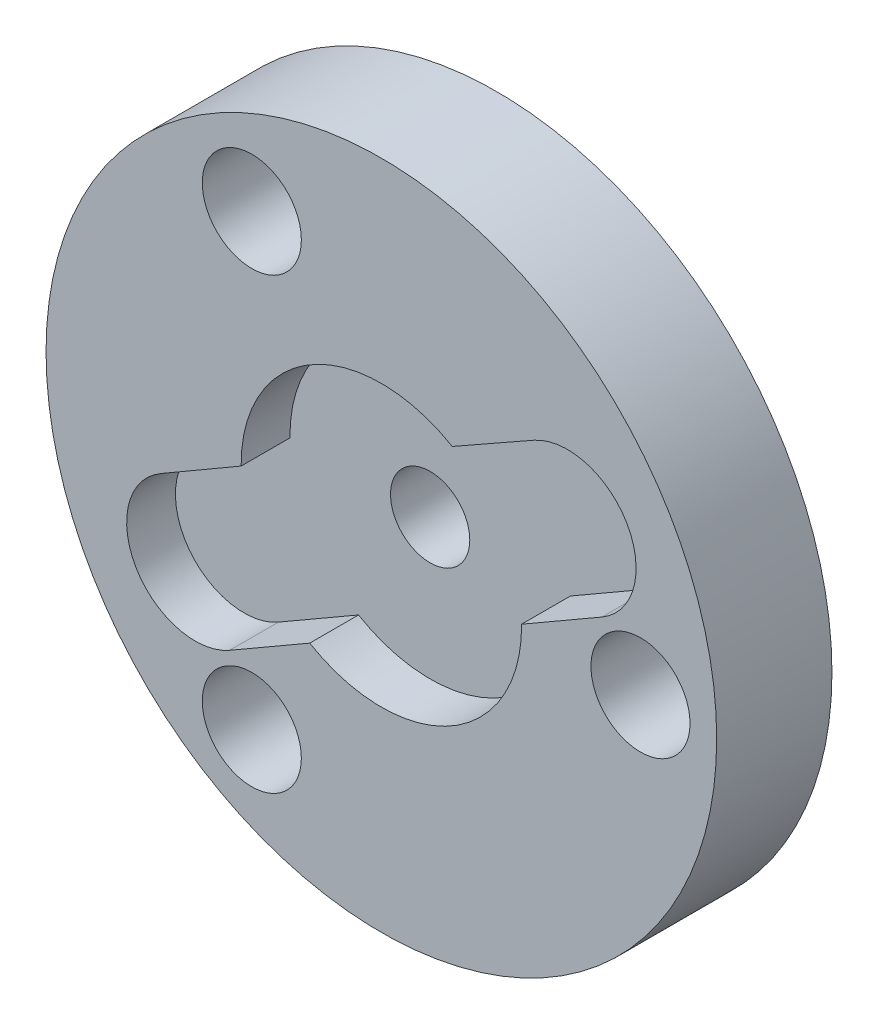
ISO-10303-21;
HEADER;
FILE_DESCRIPTION(('STEP AP214'),'2;1');
FILE_NAME('part.step','',(''),(''),'','','');
FILE_SCHEMA(('AUTOMOTIVE_DESIGN { 1 0 10303 214 1 1 1 1 }'));
ENDSEC;
DATA;
#1=APPLICATION_CONTEXT('core data for automotive mechanical design processes');
#2=APPLICATION_PROTOCOL_DEFINITION('international standard','automotive_design',2000,#1);
#3=PRODUCT_CONTEXT('',#1,'mechanical');
#4=PRODUCT('Part','Part','',(#3));
#5=PRODUCT_RELATED_PRODUCT_CATEGORY('part','',(#4));
#6=PRODUCT_DEFINITION_FORMATION('','',#4);
#7=PRODUCT_DEFINITION_CONTEXT('part definition',#1,'design');
#8=PRODUCT_DEFINITION('design','',#6,#7);
#9=PRODUCT_DEFINITION_SHAPE('','',#8);
#10=(LENGTH_UNIT() NAMED_UNIT(*) SI_UNIT(.MILLI.,.METRE.));
#11=(NAMED_UNIT(*) PLANE_ANGLE_UNIT() SI_UNIT($,.RADIAN.));
#12=(NAMED_UNIT(*) SI_UNIT($,.STERADIAN.) SOLID_ANGLE_UNIT());
#13=UNCERTAINTY_MEASURE_WITH_UNIT(LENGTH_MEASURE(1.E-05),#10,'distance_accuracy_value','');
#14=(GEOMETRIC_REPRESENTATION_CONTEXT(3) GLOBAL_UNCERTAINTY_ASSIGNED_CONTEXT((#13)) GLOBAL_UNIT_ASSIGNED_CONTEXT((#10,
#11,#12)) REPRESENTATION_CONTEXT('',''));
#15=CARTESIAN_POINT('',(0.,0.,0.));
#16=DIRECTION('',(0.,0.,1.));
#17=DIRECTION('',(1.,0.,0.));
#18=AXIS2_PLACEMENT_3D('',#15,#16,#17);
#19=CARTESIAN_POINT('',(0.,0.,0.));
#20=DIRECTION('',(0.,0.,1.));
#21=DIRECTION('',(1.,0.,0.));
#22=AXIS2_PLACEMENT_3D('',#19,#20,#21);
#23=CYLINDRICAL_SURFACE('',#22,1.3);
#24=CARTESIAN_POINT('',(0.,0.,0.));
#25=DIRECTION('',(0.,0.,1.));
#26=DIRECTION('',(1.,0.,0.));
#27=AXIS2_PLACEMENT_3D('',#24,#25,#26);
#28=CIRCLE('',#27,1.3);
#29=CARTESIAN_POINT('',(1.3,0.,0.));
#30=VERTEX_POINT('',#29);
#31=EDGE_CURVE('E192',#30,#30,#28,.T.);
#32=CARTESIAN_POINT('',(0.,0.,2.18109250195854));
#33=DIRECTION('',(0.,0.,1.));
#34=DIRECTION('',(1.,0.,0.));
#35=AXIS2_PLACEMENT_3D('',#32,#33,#34);
#36=CIRCLE('',#35,1.3);
#37=CARTESIAN_POINT('',(1.3,0.,2.18109250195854));
#38=VERTEX_POINT('',#37);
#39=EDGE_CURVE('E183',#38,#38,#36,.F.);
#40=CARTESIAN_POINT('',(1.3,0.,0.));
#41=CARTESIAN_POINT('',(1.3,0.,0.0227197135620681));
#42=CARTESIAN_POINT('',(1.3,0.,0.0454394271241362));
#43=CARTESIAN_POINT('',(1.3,0.,0.0908788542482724));
#44=CARTESIAN_POINT('',(1.3,0.,0.11359856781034));
#45=CARTESIAN_POINT('',(1.3,0.,0.159037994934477));
#46=CARTESIAN_POINT('',(1.3,0.,0.181757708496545));
#47=CARTESIAN_POINT('',(1.3,0.,0.227197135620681));
#48=CARTESIAN_POINT('',(1.3,0.,0.249916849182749));
#49=CARTESIAN_POINT('',(1.3,0.,0.295356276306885));
#50=CARTESIAN_POINT('',(1.3,0.,0.318075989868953));
#51=CARTESIAN_POINT('',(1.3,0.,0.363515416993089));
#52=CARTESIAN_POINT('',(1.3,0.,0.386235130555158));
#53=CARTESIAN_POINT('',(1.3,0.,0.431674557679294));
#54=CARTESIAN_POINT('',(1.3,0.,0.454394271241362));
#55=CARTESIAN_POINT('',(1.3,0.,0.499833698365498));
#56=CARTESIAN_POINT('',(1.3,0.,0.522553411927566));
#57=CARTESIAN_POINT('',(1.3,0.,0.567992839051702));
#58=CARTESIAN_POINT('',(1.3,0.,0.59071255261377));
#59=CARTESIAN_POINT('',(1.3,0.,0.636151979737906));
#60=CARTESIAN_POINT('',(1.3,0.,0.658871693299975));
#61=CARTESIAN_POINT('',(1.3,0.,0.704311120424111));
#62=CARTESIAN_POINT('',(1.3,0.,0.727030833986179));
#63=CARTESIAN_POINT('',(1.3,0.,0.772470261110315));
#64=CARTESIAN_POINT('',(1.3,0.,0.795189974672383));
#65=CARTESIAN_POINT('',(1.3,0.,0.840629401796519));
#66=CARTESIAN_POINT('',(1.3,0.,0.863349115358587));
#67=CARTESIAN_POINT('',(1.3,0.,0.908788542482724));
#68=CARTESIAN_POINT('',(1.3,0.,0.931508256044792));
#69=CARTESIAN_POINT('',(1.3,0.,0.976947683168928));
#70=CARTESIAN_POINT('',(1.3,0.,0.999667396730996));
#71=CARTESIAN_POINT('',(1.3,0.,1.04510682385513));
#72=CARTESIAN_POINT('',(1.3,0.,1.0678265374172));
#73=CARTESIAN_POINT('',(1.3,0.,1.11326596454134));
#74=CARTESIAN_POINT('',(1.3,0.,1.1359856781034));
#75=CARTESIAN_POINT('',(1.3,0.,1.18142510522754));
#76=CARTESIAN_POINT('',(1.3,0.,1.20414481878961));
#77=CARTESIAN_POINT('',(1.3,0.,1.24958424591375));
#78=CARTESIAN_POINT('',(1.3,0.,1.27230395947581));
#79=CARTESIAN_POINT('',(1.3,0.,1.31774338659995));
#80=CARTESIAN_POINT('',(1.3,0.,1.34046310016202));
#81=CARTESIAN_POINT('',(1.3,0.,1.38590252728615));
#82=CARTESIAN_POINT('',(1.3,0.,1.40862224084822));
#83=CARTESIAN_POINT('',(1.3,0.,1.45406166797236));
#84=CARTESIAN_POINT('',(1.3,0.,1.47678138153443));
#85=CARTESIAN_POINT('',(1.3,0.,1.52222080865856));
#86=CARTESIAN_POINT('',(1.3,0.,1.54494052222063));
#87=CARTESIAN_POINT('',(1.3,0.,1.59037994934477));
#88=CARTESIAN_POINT('',(1.3,0.,1.61309966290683));
#89=CARTESIAN_POINT('',(1.3,0.,1.65853909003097));
#90=CARTESIAN_POINT('',(1.3,0.,1.68125880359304));
#91=CARTESIAN_POINT('',(1.3,0.,1.72669823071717));
#92=CARTESIAN_POINT('',(1.3,0.,1.74941794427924));
#93=CARTESIAN_POINT('',(1.3,0.,1.79485737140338));
#94=CARTESIAN_POINT('',(1.3,0.,1.81757708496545));
#95=CARTESIAN_POINT('',(1.3,0.,1.86301651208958));
#96=CARTESIAN_POINT('',(1.3,0.,1.88573622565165));
#97=CARTESIAN_POINT('',(1.3,0.,1.93117565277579));
#98=CARTESIAN_POINT('',(1.3,0.,1.95389536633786));
#99=CARTESIAN_POINT('',(1.3,0.,1.99933479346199));
#100=CARTESIAN_POINT('',(1.3,0.,2.02205450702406));
#101=CARTESIAN_POINT('',(1.3,0.,2.0674939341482));
#102=CARTESIAN_POINT('',(1.3,0.,2.09021364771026));
#103=CARTESIAN_POINT('',(1.3,0.,2.1356530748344));
#104=CARTESIAN_POINT('',(1.3,0.,2.15837278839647));
#105=CARTESIAN_POINT('',(1.3,0.,2.18109250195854));
#106=B_SPLINE_CURVE_WITH_KNOTS('',3,(#40,#41,#42,#43,#44,#45,#46,#47,#48,#49,#50,#51,#52,#53,
#54,#55,#56,#57,#58,#59,#60,#61,#62,#63,#64,#65,#66,#67,#68,#69,#70,#71,#72,#73,#74,#75,#76,#77,
#78,#79,#80,#81,#82,#83,#84,#85,#86,#87,#88,#89,#90,#91,#92,#93,#94,#95,#96,#97,#98,#99,#100,
#101,#102,#103,#104,#105),.UNSPECIFIED.,.F.,.F.,(4,2,2,2,2,2,2,2,2,2,2,2,2,2,2,2,2,2,2,2,2,2,2,
2,2,2,2,2,2,2,2,2,4),(0.,0.0681591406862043,0.136318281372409,0.204477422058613,
0.272636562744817,0.340795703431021,0.408954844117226,0.47711398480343,0.545273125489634,
0.613432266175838,0.681591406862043,0.749750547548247,0.817909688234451,0.886068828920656,
0.95422796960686,1.02238711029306,1.09054625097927,1.15870539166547,1.22686453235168,
1.29502367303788,1.36318281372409,1.43134195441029,1.49950109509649,1.5676602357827,
1.6358193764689,1.70397851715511,1.77213765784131,1.84029679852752,1.90845593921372,
1.97661507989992,2.04477422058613,2.11293336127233,2.18109250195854),.UNSPECIFIED.);
#107=EDGE_CURVE('BSEAM39',#30,#38,#106,.T.);
#108=ORIENTED_EDGE('',*,*,#31,.F.);
#109=ORIENTED_EDGE('',*,*,#39,.F.);
#110=ORIENTED_EDGE('',*,*,#107,.T.);
#111=ORIENTED_EDGE('',*,*,#107,.F.);
#112=EDGE_LOOP('',(#108,#110,#109,#111));
#113=FACE_BOUND('',#112,.T.);
#114=ADVANCED_FACE('F39',(#113),#23,.F.);
#115=CARTESIAN_POINT('',(0.,0.,3.78109250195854));
#116=DIRECTION('',(0.,0.,-1.));
#117=DIRECTION('',(-1.,0.,0.));
#118=AXIS2_PLACEMENT_3D('',#115,#116,#117);
#119=CYLINDRICAL_SURFACE('',#118,11.);
#120=CARTESIAN_POINT('',(0.,0.,3.78109250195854));
#121=DIRECTION('',(0.,0.,1.));
#122=DIRECTION('',(1.,0.,0.));
#123=AXIS2_PLACEMENT_3D('',#120,#121,#122);
#124=CIRCLE('',#123,11.);
#125=CARTESIAN_POINT('',(-11.,0.,3.78109250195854));
#126=VERTEX_POINT('',#125);
#127=EDGE_CURVE('E11',#126,#126,#124,.T.);
#128=CARTESIAN_POINT('',(0.,0.,0.));
#129=DIRECTION('',(0.,0.,1.));
#130=DIRECTION('',(1.,0.,0.));
#131=AXIS2_PLACEMENT_3D('',#128,#129,#130);
#132=CIRCLE('',#131,11.);
#133=CARTESIAN_POINT('',(-11.,0.,0.));
#134=VERTEX_POINT('',#133);
#135=EDGE_CURVE('E43',#134,#134,#132,.T.);
#136=CARTESIAN_POINT('',(-11.,0.,3.78109250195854));
#137=CARTESIAN_POINT('',(-11.,0.,3.7417061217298));
#138=CARTESIAN_POINT('',(-11.,0.,3.70231974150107));
#139=CARTESIAN_POINT('',(-11.,0.,3.6235469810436));
#140=CARTESIAN_POINT('',(-11.,0.,3.58416060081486));
#141=CARTESIAN_POINT('',(-11.,0.,3.50538784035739));
#142=CARTESIAN_POINT('',(-11.,0.,3.46600146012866));
#143=CARTESIAN_POINT('',(-11.,0.,3.38722869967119));
#144=CARTESIAN_POINT('',(-11.,0.,3.34784231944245));
#145=CARTESIAN_POINT('',(-11.,0.,3.26906955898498));
#146=CARTESIAN_POINT('',(-11.,0.,3.22968317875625));
#147=CARTESIAN_POINT('',(-11.,0.,3.15091041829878));
#148=CARTESIAN_POINT('',(-11.,0.,3.11152403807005));
#149=CARTESIAN_POINT('',(-11.,0.,3.03275127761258));
#150=CARTESIAN_POINT('',(-11.,0.,2.99336489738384));
#151=CARTESIAN_POINT('',(-11.,0.,2.91459213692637));
#152=CARTESIAN_POINT('',(-11.,0.,2.87520575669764));
#153=CARTESIAN_POINT('',(-11.,0.,2.79643299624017));
#154=CARTESIAN_POINT('',(-11.,0.,2.75704661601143));
#155=CARTESIAN_POINT('',(-11.,0.,2.67827385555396));
#156=CARTESIAN_POINT('',(-11.,0.,2.63888747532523));
#157=CARTESIAN_POINT('',(-11.,0.,2.56011471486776));
#158=CARTESIAN_POINT('',(-11.,0.,2.52072833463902));
#159=CARTESIAN_POINT('',(-11.,0.,2.44195557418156));
#160=CARTESIAN_POINT('',(-11.,0.,2.40256919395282));
#161=CARTESIAN_POINT('',(-11.,0.,2.32379643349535));
#162=CARTESIAN_POINT('',(-11.,0.,2.28441005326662));
#163=CARTESIAN_POINT('',(-11.,0.,2.20563729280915));
#164=CARTESIAN_POINT('',(-11.,0.,2.16625091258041));
#165=CARTESIAN_POINT('',(-11.,0.,2.08747815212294));
#166=CARTESIAN_POINT('',(-11.,0.,2.04809177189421));
#167=CARTESIAN_POINT('',(-11.,0.,1.96931901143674));
#168=CARTESIAN_POINT('',(-11.,0.,1.929932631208));
#169=CARTESIAN_POINT('',(-11.,0.,1.85115987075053));
#170=CARTESIAN_POINT('',(-11.,0.,1.8117734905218));
#171=CARTESIAN_POINT('',(-11.,0.,1.73300073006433));
#172=CARTESIAN_POINT('',(-11.,0.,1.69361434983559));
#173=CARTESIAN_POINT('',(-11.,0.,1.61484158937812));
#174=CARTESIAN_POINT('',(-11.,0.,1.57545520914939));
#175=CARTESIAN_POINT('',(-11.,0.,1.49668244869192));
#176=CARTESIAN_POINT('',(-11.,0.,1.45729606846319));
#177=CARTESIAN_POINT('',(-11.,0.,1.37852330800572));
#178=CARTESIAN_POINT('',(-11.,0.,1.33913692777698));
#179=CARTESIAN_POINT('',(-11.,0.,1.26036416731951));
#180=CARTESIAN_POINT('',(-11.,0.,1.22097778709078));
#181=CARTESIAN_POINT('',(-11.,0.,1.14220502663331));
#182=CARTESIAN_POINT('',(-11.,0.,1.10281864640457));
#183=CARTESIAN_POINT('',(-11.,0.,1.0240458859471));
#184=CARTESIAN_POINT('',(-11.,0.,0.984659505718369));
#185=CARTESIAN_POINT('',(-11.,0.,0.905886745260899));
#186=CARTESIAN_POINT('',(-11.,0.,0.866500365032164));
#187=CARTESIAN_POINT('',(-11.,0.,0.787727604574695));
#188=CARTESIAN_POINT('',(-11.,0.,0.74834122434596));
#189=CARTESIAN_POINT('',(-11.,0.,0.669568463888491));
#190=CARTESIAN_POINT('',(-11.,0.,0.630182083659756));
#191=CARTESIAN_POINT('',(-11.,0.,0.551409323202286));
#192=CARTESIAN_POINT('',(-11.,0.,0.512022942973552));
#193=CARTESIAN_POINT('',(-11.,0.,0.433250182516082));
#194=CARTESIAN_POINT('',(-11.,0.,0.393863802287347));
#195=CARTESIAN_POINT('',(-11.,0.,0.315091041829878));
#196=CARTESIAN_POINT('',(-11.,0.,0.275704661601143));
#197=CARTESIAN_POINT('',(-11.,0.,0.196931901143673));
#198=CARTESIAN_POINT('',(-11.,0.,0.157545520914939));
#199=CARTESIAN_POINT('',(-11.,0.,0.0787727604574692));
#200=CARTESIAN_POINT('',(-11.,0.,0.0393863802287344));
#201=CARTESIAN_POINT('',(-11.,0.,0.));
#202=B_SPLINE_CURVE_WITH_KNOTS('',3,(#136,#137,#138,#139,#140,#141,#142,#143,#144,#145,#146,
#147,#148,#149,#150,#151,#152,#153,#154,#155,#156,#157,#158,#159,#160,#161,#162,#163,#164,#165,
#166,#167,#168,#169,#170,#171,#172,#173,#174,#175,#176,#177,#178,#179,#180,#181,#182,#183,#184,
#185,#186,#187,#188,#189,#190,#191,#192,#193,#194,#195,#196,#197,#198,#199,#200,#201),
.UNSPECIFIED.,.F.,.F.,(4,2,2,2,2,2,2,2,2,2,2,2,2,2,2,2,2,2,2,2,2,2,2,2,2,2,2,2,2,2,2,2,4),(0.,
0.118159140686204,0.236318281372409,0.354477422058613,0.472636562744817,0.590795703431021,
0.708954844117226,0.82711398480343,0.945273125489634,1.06343226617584,1.18159140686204,
1.29975054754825,1.41790968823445,1.53606882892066,1.65422796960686,1.77238711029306,
1.89054625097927,2.00870539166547,2.12686453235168,2.24502367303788,2.36318281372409,
2.48134195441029,2.59950109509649,2.7176602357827,2.8358193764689,2.95397851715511,
3.07213765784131,3.19029679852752,3.30845593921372,3.42661507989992,3.54477422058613,
3.66293336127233,3.78109250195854),.UNSPECIFIED.);
#203=EDGE_CURVE('BSEAM41',#126,#134,#202,.T.);
#204=ORIENTED_EDGE('',*,*,#127,.F.);
#205=ORIENTED_EDGE('',*,*,#135,.T.);
#206=ORIENTED_EDGE('',*,*,#203,.T.);
#207=ORIENTED_EDGE('',*,*,#203,.F.);
#208=EDGE_LOOP('',(#204,#206,#205,#207));
#209=FACE_BOUND('',#208,.T.);
#210=ADVANCED_FACE('F41',(#209),#119,.T.);
#211=CARTESIAN_POINT('',(0.,0.,3.78109250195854));
#212=DIRECTION('',(0.,0.,1.));
#213=DIRECTION('',(1.,0.,0.));
#214=AXIS2_PLACEMENT_3D('',#211,#212,#213);
#215=PLANE('',#214);
#216=CARTESIAN_POINT('',(0.,0.,3.78109250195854));
#217=DIRECTION('',(0.,0.,1.));
#218=DIRECTION('',(1.,0.,0.));
#219=AXIS2_PLACEMENT_3D('',#216,#217,#218);
#220=CIRCLE('',#219,4.6);
#221=CARTESIAN_POINT('',(2.32469305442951,3.96935790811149,3.78109250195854));
#222=VERTEX_POINT('',#221);
#223=CARTESIAN_POINT('',(-4.59973302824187,-0.0495587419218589,3.78109250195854));
#224=VERTEX_POINT('',#223);
#225=EDGE_CURVE('E55',#222,#224,#220,.T.);
#226=ORIENTED_EDGE('',*,*,#225,.F.);
#227=DIRECTION('',(-0.870114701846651,-0.492849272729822,0.));
#228=VECTOR('',#227,1.);
#229=CARTESIAN_POINT('',(-1.13753229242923,2.00828859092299,3.78109250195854));
#230=LINE('',#229,#228);
#231=CARTESIAN_POINT('',(4.9965682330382,5.48275807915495,3.78109250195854));
#232=VERTEX_POINT('',#231);
#233=EDGE_CURVE('E156',#232,#222,#230,.T.);
#234=ORIENTED_EDGE('',*,*,#233,.F.);
#235=CARTESIAN_POINT('',(6.1054790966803,3.52499999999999,3.78109250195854));
#236=DIRECTION('',(0.,0.,1.));
#237=DIRECTION('',(1.,0.,0.));
#238=AXIS2_PLACEMENT_3D('',#235,#236,#237);
#239=CIRCLE('',#238,2.25);
#240=CARTESIAN_POINT('',(7.23047828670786,1.57644237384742,3.78109250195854));
#241=VERTEX_POINT('',#240);
#242=EDGE_CURVE('E158',#241,#232,#239,.T.);
#243=ORIENTED_EDGE('',*,*,#242,.F.);
#244=DIRECTION('',(0.866025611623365,0.499999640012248,0.));
#245=VECTOR('',#244,1.);
#246=CARTESIAN_POINT('',(1.12499772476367,-1.94855508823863,3.78109250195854));
#247=LINE('',#246,#245);
#248=CARTESIAN_POINT('',(4.59964025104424,0.0575287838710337,3.78109250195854));
#249=VERTEX_POINT('',#248);
#250=EDGE_CURVE('E115',#249,#241,#247,.T.);
#251=ORIENTED_EDGE('',*,*,#250,.F.);
#252=CARTESIAN_POINT('',(0.,0.,3.78109250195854));
#253=DIRECTION('',(0.,0.,1.));
#254=DIRECTION('',(1.,0.,0.));
#255=AXIS2_PLACEMENT_3D('',#252,#253,#254);
#256=CIRCLE('',#255,4.6);
#257=CARTESIAN_POINT('',(-2.34964480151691,-3.95463896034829,3.78109250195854));
#258=VERTEX_POINT('',#257);
#259=EDGE_CURVE('E397',#258,#249,#256,.T.);
#260=ORIENTED_EDGE('',*,*,#259,.F.);
#261=CARTESIAN_POINT('',(-4.97603524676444,-5.47098473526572,3.78109250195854));
#262=VERTEX_POINT('',#261);
#263=EDGE_CURVE('E392',#262,#258,#247,.T.);
#264=ORIENTED_EDGE('',*,*,#263,.F.);
#265=CARTESIAN_POINT('',(-6.1054790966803,-3.52499999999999,3.78109250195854));
#266=DIRECTION('',(0.,0.,1.));
#267=DIRECTION('',(1.,0.,0.));
#268=AXIS2_PLACEMENT_3D('',#265,#266,#267);
#269=CIRCLE('',#268,2.25);
#270=CARTESIAN_POINT('',(-7.23492294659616,-1.57901526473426,3.78109250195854));
#271=VERTEX_POINT('',#270);
#272=EDGE_CURVE('E398',#271,#262,#269,.T.);
#273=ORIENTED_EDGE('',*,*,#272,.F.);
#274=DIRECTION('',(-0.864882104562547,-0.50197504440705,0.));
#275=VECTOR('',#274,1.);
#276=CARTESIAN_POINT('',(-1.13751998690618,1.95989958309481,3.78109250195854));
#277=LINE('',#276,#275);
#278=EDGE_CURVE('E406',#224,#271,#277,.T.);
#279=ORIENTED_EDGE('',*,*,#278,.F.);
#280=EDGE_LOOP('',(#226,#234,#243,#251,#260,#264,#273,#279));
#281=FACE_BOUND('',#280,.T.);
#282=CARTESIAN_POINT('',(-4.24999999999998,7.36121593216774,3.78109250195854));
#283=DIRECTION('',(0.,0.,1.));
#284=DIRECTION('',(1.,0.,0.));
#285=AXIS2_PLACEMENT_3D('',#282,#283,#284);
#286=CIRCLE('',#285,1.625);
#287=CARTESIAN_POINT('',(-2.62499999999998,7.36121593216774,3.78109250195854));
#288=VERTEX_POINT('',#287);
#289=EDGE_CURVE('E188',#288,#288,#286,.T.);
#290=ORIENTED_EDGE('',*,*,#289,.F.);
#291=EDGE_LOOP('',(#290));
#292=FACE_BOUND('',#291,.T.);
#293=CARTESIAN_POINT('',(-4.24999999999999,-7.36121593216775,3.78109250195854));
#294=DIRECTION('',(0.,0.,1.));
#295=DIRECTION('',(1.,0.,0.));
#296=AXIS2_PLACEMENT_3D('',#293,#294,#295);
#297=CIRCLE('',#296,1.625);
#298=CARTESIAN_POINT('',(-2.62499999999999,-7.36121593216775,3.78109250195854));
#299=VERTEX_POINT('',#298);
#300=EDGE_CURVE('E200',#299,#299,#297,.T.);
#301=ORIENTED_EDGE('',*,*,#300,.F.);
#302=EDGE_LOOP('',(#301));
#303=FACE_BOUND('',#302,.T.);
#304=CARTESIAN_POINT('',(8.5,0.,3.78109250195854));
#305=DIRECTION('',(0.,0.,1.));
#306=DIRECTION('',(1.,0.,0.));
#307=AXIS2_PLACEMENT_3D('',#304,#305,#306);
#308=CIRCLE('',#307,1.625);
#309=CARTESIAN_POINT('',(10.125,0.,3.78109250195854));
#310=VERTEX_POINT('',#309);
#311=EDGE_CURVE('E167',#310,#310,#308,.T.);
#312=ORIENTED_EDGE('',*,*,#311,.F.);
#313=EDGE_LOOP('',(#312));
#314=FACE_BOUND('',#313,.T.);
#315=ORIENTED_EDGE('',*,*,#127,.T.);
#316=EDGE_LOOP('',(#315));
#317=FACE_BOUND('',#316,.T.);
#318=ADVANCED_FACE('F214',(#281,#292,#303,#314,#317),#215,.T.);
#319=CARTESIAN_POINT('',(0.,0.,0.));
#320=DIRECTION('',(0.,0.,1.));
#321=DIRECTION('',(1.,0.,0.));
#322=AXIS2_PLACEMENT_3D('',#319,#320,#321);
#323=PLANE('',#322);
#324=CARTESIAN_POINT('',(-4.24999999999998,7.36121593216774,0.));
#325=DIRECTION('',(0.,0.,1.));
#326=DIRECTION('',(1.,0.,0.));
#327=AXIS2_PLACEMENT_3D('',#324,#325,#326);
#328=CIRCLE('',#327,1.625);
#329=CARTESIAN_POINT('',(-2.62499999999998,7.36121593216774,0.));
#330=VERTEX_POINT('',#329);
#331=EDGE_CURVE('E184',#330,#330,#328,.T.);
#332=ORIENTED_EDGE('',*,*,#331,.T.);
#333=EDGE_LOOP('',(#332));
#334=FACE_BOUND('',#333,.T.);
#335=ORIENTED_EDGE('',*,*,#31,.T.);
#336=EDGE_LOOP('',(#335));
#337=FACE_BOUND('',#336,.T.);
#338=CARTESIAN_POINT('',(-4.24999999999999,-7.36121593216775,0.));
#339=DIRECTION('',(0.,0.,1.));
#340=DIRECTION('',(1.,0.,0.));
#341=AXIS2_PLACEMENT_3D('',#338,#339,#340);
#342=CIRCLE('',#341,1.625);
#343=CARTESIAN_POINT('',(-2.62499999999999,-7.36121593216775,0.));
#344=VERTEX_POINT('',#343);
#345=EDGE_CURVE('E196',#344,#344,#342,.T.);
#346=ORIENTED_EDGE('',*,*,#345,.T.);
#347=EDGE_LOOP('',(#346));
#348=FACE_BOUND('',#347,.T.);
#349=CARTESIAN_POINT('',(8.5,0.,0.));
#350=DIRECTION('',(0.,0.,1.));
#351=DIRECTION('',(1.,0.,0.));
#352=AXIS2_PLACEMENT_3D('',#349,#350,#351);
#353=CIRCLE('',#352,1.625);
#354=CARTESIAN_POINT('',(10.125,0.,0.));
#355=VERTEX_POINT('',#354);
#356=EDGE_CURVE('E204',#355,#355,#353,.T.);
#357=ORIENTED_EDGE('',*,*,#356,.T.);
#358=EDGE_LOOP('',(#357));
#359=FACE_BOUND('',#358,.T.);
#360=ORIENTED_EDGE('',*,*,#135,.F.);
#361=EDGE_LOOP('',(#360));
#362=FACE_BOUND('',#361,.T.);
#363=ADVANCED_FACE('F217',(#334,#337,#348,#359,#362),#323,.F.);
#364=CARTESIAN_POINT('',(8.5,0.,0.));
#365=DIRECTION('',(0.,0.,1.));
#366=DIRECTION('',(1.,0.,0.));
#367=AXIS2_PLACEMENT_3D('',#364,#365,#366);
#368=CYLINDRICAL_SURFACE('',#367,1.625);
#369=CARTESIAN_POINT('',(10.125,0.,0.));
#370=CARTESIAN_POINT('',(10.125,0.,0.0393863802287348));
#371=CARTESIAN_POINT('',(10.125,0.,0.0787727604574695));
#372=CARTESIAN_POINT('',(10.125,0.,0.157545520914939));
#373=CARTESIAN_POINT('',(10.125,0.,0.196931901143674));
#374=CARTESIAN_POINT('',(10.125,0.,0.275704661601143));
#375=CARTESIAN_POINT('',(10.125,0.,0.315091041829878));
#376=CARTESIAN_POINT('',(10.125,0.,0.393863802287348));
#377=CARTESIAN_POINT('',(10.125,0.,0.433250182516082));
#378=CARTESIAN_POINT('',(10.125,0.,0.512022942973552));
#379=CARTESIAN_POINT('',(10.125,0.,0.551409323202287));
#380=CARTESIAN_POINT('',(10.125,0.,0.630182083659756));
#381=CARTESIAN_POINT('',(10.125,0.,0.669568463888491));
#382=CARTESIAN_POINT('',(10.125,0.,0.74834122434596));
#383=CARTESIAN_POINT('',(10.125,0.,0.787727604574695));
#384=CARTESIAN_POINT('',(10.125,0.,0.866500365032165));
#385=CARTESIAN_POINT('',(10.125,0.,0.905886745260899));
#386=CARTESIAN_POINT('',(10.125,0.,0.984659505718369));
#387=CARTESIAN_POINT('',(10.125,0.,1.0240458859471));
#388=CARTESIAN_POINT('',(10.125,0.,1.10281864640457));
#389=CARTESIAN_POINT('',(10.125,0.,1.14220502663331));
#390=CARTESIAN_POINT('',(10.125,0.,1.22097778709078));
#391=CARTESIAN_POINT('',(10.125,0.,1.26036416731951));
#392=CARTESIAN_POINT('',(10.125,0.,1.33913692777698));
#393=CARTESIAN_POINT('',(10.125,0.,1.37852330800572));
#394=CARTESIAN_POINT('',(10.125,0.,1.45729606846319));
#395=CARTESIAN_POINT('',(10.125,0.,1.49668244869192));
#396=CARTESIAN_POINT('',(10.125,0.,1.57545520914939));
#397=CARTESIAN_POINT('',(10.125,0.,1.61484158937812));
#398=CARTESIAN_POINT('',(10.125,0.,1.69361434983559));
#399=CARTESIAN_POINT('',(10.125,0.,1.73300073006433));
#400=CARTESIAN_POINT('',(10.125,0.,1.8117734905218));
#401=CARTESIAN_POINT('',(10.125,0.,1.85115987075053));
#402=CARTESIAN_POINT('',(10.125,0.,1.929932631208));
#403=CARTESIAN_POINT('',(10.125,0.,1.96931901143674));
#404=CARTESIAN_POINT('',(10.125,0.,2.04809177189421));
#405=CARTESIAN_POINT('',(10.125,0.,2.08747815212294));
#406=CARTESIAN_POINT('',(10.125,0.,2.16625091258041));
#407=CARTESIAN_POINT('',(10.125,0.,2.20563729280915));
#408=CARTESIAN_POINT('',(10.125,0.,2.28441005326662));
#409=CARTESIAN_POINT('',(10.125,0.,2.32379643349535));
#410=CARTESIAN_POINT('',(10.125,0.,2.40256919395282));
#411=CARTESIAN_POINT('',(10.125,0.,2.44195557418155));
#412=CARTESIAN_POINT('',(10.125,0.,2.52072833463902));
#413=CARTESIAN_POINT('',(10.125,0.,2.56011471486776));
#414=CARTESIAN_POINT('',(10.125,0.,2.63888747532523));
#415=CARTESIAN_POINT('',(10.125,0.,2.67827385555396));
#416=CARTESIAN_POINT('',(10.125,0.,2.75704661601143));
#417=CARTESIAN_POINT('',(10.125,0.,2.79643299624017));
#418=CARTESIAN_POINT('',(10.125,0.,2.87520575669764));
#419=CARTESIAN_POINT('',(10.125,0.,2.91459213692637));
#420=CARTESIAN_POINT('',(10.125,0.,2.99336489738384));
#421=CARTESIAN_POINT('',(10.125,0.,3.03275127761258));
#422=CARTESIAN_POINT('',(10.125,0.,3.11152403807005));
#423=CARTESIAN_POINT('',(10.125,0.,3.15091041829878));
#424=CARTESIAN_POINT('',(10.125,0.,3.22968317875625));
#425=CARTESIAN_POINT('',(10.125,0.,3.26906955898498));
#426=CARTESIAN_POINT('',(10.125,0.,3.34784231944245));
#427=CARTESIAN_POINT('',(10.125,0.,3.38722869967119));
#428=CARTESIAN_POINT('',(10.125,0.,3.46600146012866));
#429=CARTESIAN_POINT('',(10.125,0.,3.50538784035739));
#430=CARTESIAN_POINT('',(10.125,0.,3.58416060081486));
#431=CARTESIAN_POINT('',(10.125,0.,3.6235469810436));
#432=CARTESIAN_POINT('',(10.125,0.,3.70231974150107));
#433=CARTESIAN_POINT('',(10.125,0.,3.7417061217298));
#434=CARTESIAN_POINT('',(10.125,0.,3.78109250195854));
#435=B_SPLINE_CURVE_WITH_KNOTS('',3,(#369,#370,#371,#372,#373,#374,#375,#376,#377,#378,#379,
#380,#381,#382,#383,#384,#385,#386,#387,#388,#389,#390,#391,#392,#393,#394,#395,#396,#397,#398,
#399,#400,#401,#402,#403,#404,#405,#406,#407,#408,#409,#410,#411,#412,#413,#414,#415,#416,#417,
#418,#419,#420,#421,#422,#423,#424,#425,#426,#427,#428,#429,#430,#431,#432,#433,#434),
.UNSPECIFIED.,.F.,.F.,(4,2,2,2,2,2,2,2,2,2,2,2,2,2,2,2,2,2,2,2,2,2,2,2,2,2,2,2,2,2,2,2,4),(0.,
0.118159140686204,0.236318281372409,0.354477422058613,0.472636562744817,0.590795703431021,
0.708954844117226,0.82711398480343,0.945273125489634,1.06343226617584,1.18159140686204,
1.29975054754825,1.41790968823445,1.53606882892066,1.65422796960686,1.77238711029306,
1.89054625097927,2.00870539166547,2.12686453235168,2.24502367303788,2.36318281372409,
2.48134195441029,2.59950109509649,2.7176602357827,2.8358193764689,2.95397851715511,
3.07213765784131,3.19029679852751,3.30845593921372,3.42661507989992,3.54477422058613,
3.66293336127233,3.78109250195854),.UNSPECIFIED.);
#436=EDGE_CURVE('BSEAM212',#355,#310,#435,.T.);
#437=ORIENTED_EDGE('',*,*,#356,.F.);
#438=ORIENTED_EDGE('',*,*,#311,.T.);
#439=ORIENTED_EDGE('',*,*,#436,.T.);
#440=ORIENTED_EDGE('',*,*,#436,.F.);
#441=EDGE_LOOP('',(#437,#439,#438,#440));
#442=FACE_BOUND('',#441,.T.);
#443=ADVANCED_FACE('F212',(#442),#368,.F.);
#444=CARTESIAN_POINT('',(-4.24999999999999,-7.36121593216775,0.));
#445=DIRECTION('',(0.,0.,1.));
#446=DIRECTION('',(1.,0.,0.));
#447=AXIS2_PLACEMENT_3D('',#444,#445,#446);
#448=CYLINDRICAL_SURFACE('',#447,1.625);
#449=CARTESIAN_POINT('',(-2.62499999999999,-7.36121593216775,0.));
#450=CARTESIAN_POINT('',(-2.62499999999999,-7.36121593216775,0.0393863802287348));
#451=CARTESIAN_POINT('',(-2.62499999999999,-7.36121593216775,0.0787727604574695));
#452=CARTESIAN_POINT('',(-2.62499999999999,-7.36121593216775,0.157545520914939));
#453=CARTESIAN_POINT('',(-2.62499999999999,-7.36121593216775,0.196931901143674));
#454=CARTESIAN_POINT('',(-2.62499999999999,-7.36121593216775,0.275704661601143));
#455=CARTESIAN_POINT('',(-2.62499999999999,-7.36121593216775,0.315091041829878));
#456=CARTESIAN_POINT('',(-2.62499999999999,-7.36121593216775,0.393863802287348));
#457=CARTESIAN_POINT('',(-2.62499999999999,-7.36121593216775,0.433250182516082));
#458=CARTESIAN_POINT('',(-2.62499999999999,-7.36121593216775,0.512022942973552));
#459=CARTESIAN_POINT('',(-2.62499999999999,-7.36121593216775,0.551409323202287));
#460=CARTESIAN_POINT('',(-2.62499999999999,-7.36121593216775,0.630182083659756));
#461=CARTESIAN_POINT('',(-2.62499999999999,-7.36121593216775,0.669568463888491));
#462=CARTESIAN_POINT('',(-2.62499999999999,-7.36121593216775,0.74834122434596));
#463=CARTESIAN_POINT('',(-2.62499999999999,-7.36121593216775,0.787727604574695));
#464=CARTESIAN_POINT('',(-2.62499999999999,-7.36121593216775,0.866500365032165));
#465=CARTESIAN_POINT('',(-2.62499999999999,-7.36121593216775,0.905886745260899));
#466=CARTESIAN_POINT('',(-2.62499999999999,-7.36121593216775,0.984659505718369));
#467=CARTESIAN_POINT('',(-2.62499999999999,-7.36121593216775,1.0240458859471));
#468=CARTESIAN_POINT('',(-2.62499999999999,-7.36121593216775,1.10281864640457));
#469=CARTESIAN_POINT('',(-2.62499999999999,-7.36121593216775,1.14220502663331));
#470=CARTESIAN_POINT('',(-2.62499999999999,-7.36121593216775,1.22097778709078));
#471=CARTESIAN_POINT('',(-2.62499999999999,-7.36121593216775,1.26036416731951));
#472=CARTESIAN_POINT('',(-2.62499999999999,-7.36121593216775,1.33913692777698));
#473=CARTESIAN_POINT('',(-2.62499999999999,-7.36121593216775,1.37852330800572));
#474=CARTESIAN_POINT('',(-2.62499999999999,-7.36121593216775,1.45729606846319));
#475=CARTESIAN_POINT('',(-2.62499999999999,-7.36121593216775,1.49668244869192));
#476=CARTESIAN_POINT('',(-2.62499999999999,-7.36121593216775,1.57545520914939));
#477=CARTESIAN_POINT('',(-2.62499999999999,-7.36121593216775,1.61484158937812));
#478=CARTESIAN_POINT('',(-2.62499999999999,-7.36121593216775,1.69361434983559));
#479=CARTESIAN_POINT('',(-2.62499999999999,-7.36121593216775,1.73300073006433));
#480=CARTESIAN_POINT('',(-2.62499999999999,-7.36121593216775,1.8117734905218));
#481=CARTESIAN_POINT('',(-2.62499999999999,-7.36121593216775,1.85115987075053));
#482=CARTESIAN_POINT('',(-2.62499999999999,-7.36121593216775,1.929932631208));
#483=CARTESIAN_POINT('',(-2.62499999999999,-7.36121593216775,1.96931901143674));
#484=CARTESIAN_POINT('',(-2.62499999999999,-7.36121593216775,2.04809177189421));
#485=CARTESIAN_POINT('',(-2.62499999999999,-7.36121593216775,2.08747815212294));
#486=CARTESIAN_POINT('',(-2.62499999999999,-7.36121593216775,2.16625091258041));
#487=CARTESIAN_POINT('',(-2.62499999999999,-7.36121593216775,2.20563729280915));
#488=CARTESIAN_POINT('',(-2.62499999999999,-7.36121593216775,2.28441005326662));
#489=CARTESIAN_POINT('',(-2.62499999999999,-7.36121593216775,2.32379643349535));
#490=CARTESIAN_POINT('',(-2.62499999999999,-7.36121593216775,2.40256919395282));
#491=CARTESIAN_POINT('',(-2.62499999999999,-7.36121593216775,2.44195557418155));
#492=CARTESIAN_POINT('',(-2.62499999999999,-7.36121593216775,2.52072833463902));
#493=CARTESIAN_POINT('',(-2.62499999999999,-7.36121593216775,2.56011471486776));
#494=CARTESIAN_POINT('',(-2.62499999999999,-7.36121593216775,2.63888747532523));
#495=CARTESIAN_POINT('',(-2.62499999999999,-7.36121593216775,2.67827385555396));
#496=CARTESIAN_POINT('',(-2.62499999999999,-7.36121593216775,2.75704661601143));
#497=CARTESIAN_POINT('',(-2.62499999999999,-7.36121593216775,2.79643299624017));
#498=CARTESIAN_POINT('',(-2.62499999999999,-7.36121593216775,2.87520575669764));
#499=CARTESIAN_POINT('',(-2.62499999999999,-7.36121593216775,2.91459213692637));
#500=CARTESIAN_POINT('',(-2.62499999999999,-7.36121593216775,2.99336489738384));
#501=CARTESIAN_POINT('',(-2.62499999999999,-7.36121593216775,3.03275127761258));
#502=CARTESIAN_POINT('',(-2.62499999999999,-7.36121593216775,3.11152403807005));
#503=CARTESIAN_POINT('',(-2.62499999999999,-7.36121593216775,3.15091041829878));
#504=CARTESIAN_POINT('',(-2.62499999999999,-7.36121593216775,3.22968317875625));
#505=CARTESIAN_POINT('',(-2.62499999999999,-7.36121593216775,3.26906955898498));
#506=CARTESIAN_POINT('',(-2.62499999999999,-7.36121593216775,3.34784231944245));
#507=CARTESIAN_POINT('',(-2.62499999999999,-7.36121593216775,3.38722869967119));
#508=CARTESIAN_POINT('',(-2.62499999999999,-7.36121593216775,3.46600146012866));
#509=CARTESIAN_POINT('',(-2.62499999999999,-7.36121593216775,3.50538784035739));
#510=CARTESIAN_POINT('',(-2.62499999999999,-7.36121593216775,3.58416060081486));
#511=CARTESIAN_POINT('',(-2.62499999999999,-7.36121593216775,3.6235469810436));
#512=CARTESIAN_POINT('',(-2.62499999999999,-7.36121593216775,3.70231974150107));
#513=CARTESIAN_POINT('',(-2.62499999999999,-7.36121593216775,3.7417061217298));
#514=CARTESIAN_POINT('',(-2.62499999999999,-7.36121593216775,3.78109250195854));
#515=B_SPLINE_CURVE_WITH_KNOTS('',3,(#449,#450,#451,#452,#453,#454,#455,#456,#457,#458,#459,
#460,#461,#462,#463,#464,#465,#466,#467,#468,#469,#470,#471,#472,#473,#474,#475,#476,#477,#478,
#479,#480,#481,#482,#483,#484,#485,#486,#487,#488,#489,#490,#491,#492,#493,#494,#495,#496,#497,
#498,#499,#500,#501,#502,#503,#504,#505,#506,#507,#508,#509,#510,#511,#512,#513,#514),
.UNSPECIFIED.,.F.,.F.,(4,2,2,2,2,2,2,2,2,2,2,2,2,2,2,2,2,2,2,2,2,2,2,2,2,2,2,2,2,2,2,2,4),(0.,
0.118159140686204,0.236318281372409,0.354477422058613,0.472636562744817,0.590795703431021,
0.708954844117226,0.82711398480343,0.945273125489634,1.06343226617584,1.18159140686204,
1.29975054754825,1.41790968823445,1.53606882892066,1.65422796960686,1.77238711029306,
1.89054625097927,2.00870539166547,2.12686453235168,2.24502367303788,2.36318281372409,
2.48134195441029,2.59950109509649,2.7176602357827,2.8358193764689,2.95397851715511,
3.07213765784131,3.19029679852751,3.30845593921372,3.42661507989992,3.54477422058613,
3.66293336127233,3.78109250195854),.UNSPECIFIED.);
#516=EDGE_CURVE('BSEAM233',#344,#299,#515,.T.);
#517=ORIENTED_EDGE('',*,*,#345,.F.);
#518=ORIENTED_EDGE('',*,*,#300,.T.);
#519=ORIENTED_EDGE('',*,*,#516,.T.);
#520=ORIENTED_EDGE('',*,*,#516,.F.);
#521=EDGE_LOOP('',(#517,#519,#518,#520));
#522=FACE_BOUND('',#521,.T.);
#523=ADVANCED_FACE('F233',(#522),#448,.F.);
#524=CARTESIAN_POINT('',(-4.24999999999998,7.36121593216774,0.));
#525=DIRECTION('',(0.,0.,1.));
#526=DIRECTION('',(1.,0.,0.));
#527=AXIS2_PLACEMENT_3D('',#524,#525,#526);
#528=CYLINDRICAL_SURFACE('',#527,1.625);
#529=CARTESIAN_POINT('',(-2.62499999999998,7.36121593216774,0.));
#530=CARTESIAN_POINT('',(-2.62499999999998,7.36121593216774,0.0393863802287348));
#531=CARTESIAN_POINT('',(-2.62499999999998,7.36121593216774,0.0787727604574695));
#532=CARTESIAN_POINT('',(-2.62499999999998,7.36121593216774,0.157545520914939));
#533=CARTESIAN_POINT('',(-2.62499999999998,7.36121593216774,0.196931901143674));
#534=CARTESIAN_POINT('',(-2.62499999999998,7.36121593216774,0.275704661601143));
#535=CARTESIAN_POINT('',(-2.62499999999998,7.36121593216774,0.315091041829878));
#536=CARTESIAN_POINT('',(-2.62499999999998,7.36121593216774,0.393863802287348));
#537=CARTESIAN_POINT('',(-2.62499999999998,7.36121593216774,0.433250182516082));
#538=CARTESIAN_POINT('',(-2.62499999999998,7.36121593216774,0.512022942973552));
#539=CARTESIAN_POINT('',(-2.62499999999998,7.36121593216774,0.551409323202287));
#540=CARTESIAN_POINT('',(-2.62499999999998,7.36121593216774,0.630182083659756));
#541=CARTESIAN_POINT('',(-2.62499999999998,7.36121593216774,0.669568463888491));
#542=CARTESIAN_POINT('',(-2.62499999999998,7.36121593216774,0.74834122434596));
#543=CARTESIAN_POINT('',(-2.62499999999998,7.36121593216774,0.787727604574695));
#544=CARTESIAN_POINT('',(-2.62499999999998,7.36121593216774,0.866500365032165));
#545=CARTESIAN_POINT('',(-2.62499999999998,7.36121593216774,0.905886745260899));
#546=CARTESIAN_POINT('',(-2.62499999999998,7.36121593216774,0.984659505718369));
#547=CARTESIAN_POINT('',(-2.62499999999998,7.36121593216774,1.0240458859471));
#548=CARTESIAN_POINT('',(-2.62499999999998,7.36121593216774,1.10281864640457));
#549=CARTESIAN_POINT('',(-2.62499999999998,7.36121593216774,1.14220502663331));
#550=CARTESIAN_POINT('',(-2.62499999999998,7.36121593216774,1.22097778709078));
#551=CARTESIAN_POINT('',(-2.62499999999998,7.36121593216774,1.26036416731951));
#552=CARTESIAN_POINT('',(-2.62499999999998,7.36121593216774,1.33913692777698));
#553=CARTESIAN_POINT('',(-2.62499999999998,7.36121593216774,1.37852330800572));
#554=CARTESIAN_POINT('',(-2.62499999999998,7.36121593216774,1.45729606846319));
#555=CARTESIAN_POINT('',(-2.62499999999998,7.36121593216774,1.49668244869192));
#556=CARTESIAN_POINT('',(-2.62499999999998,7.36121593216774,1.57545520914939));
#557=CARTESIAN_POINT('',(-2.62499999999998,7.36121593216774,1.61484158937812));
#558=CARTESIAN_POINT('',(-2.62499999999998,7.36121593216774,1.69361434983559));
#559=CARTESIAN_POINT('',(-2.62499999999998,7.36121593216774,1.73300073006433));
#560=CARTESIAN_POINT('',(-2.62499999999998,7.36121593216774,1.8117734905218));
#561=CARTESIAN_POINT('',(-2.62499999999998,7.36121593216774,1.85115987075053));
#562=CARTESIAN_POINT('',(-2.62499999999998,7.36121593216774,1.929932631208));
#563=CARTESIAN_POINT('',(-2.62499999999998,7.36121593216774,1.96931901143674));
#564=CARTESIAN_POINT('',(-2.62499999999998,7.36121593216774,2.04809177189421));
#565=CARTESIAN_POINT('',(-2.62499999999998,7.36121593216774,2.08747815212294));
#566=CARTESIAN_POINT('',(-2.62499999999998,7.36121593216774,2.16625091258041));
#567=CARTESIAN_POINT('',(-2.62499999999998,7.36121593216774,2.20563729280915));
#568=CARTESIAN_POINT('',(-2.62499999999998,7.36121593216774,2.28441005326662));
#569=CARTESIAN_POINT('',(-2.62499999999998,7.36121593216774,2.32379643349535));
#570=CARTESIAN_POINT('',(-2.62499999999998,7.36121593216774,2.40256919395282));
#571=CARTESIAN_POINT('',(-2.62499999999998,7.36121593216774,2.44195557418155));
#572=CARTESIAN_POINT('',(-2.62499999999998,7.36121593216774,2.52072833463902));
#573=CARTESIAN_POINT('',(-2.62499999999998,7.36121593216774,2.56011471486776));
#574=CARTESIAN_POINT('',(-2.62499999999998,7.36121593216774,2.63888747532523));
#575=CARTESIAN_POINT('',(-2.62499999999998,7.36121593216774,2.67827385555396));
#576=CARTESIAN_POINT('',(-2.62499999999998,7.36121593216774,2.75704661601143));
#577=CARTESIAN_POINT('',(-2.62499999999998,7.36121593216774,2.79643299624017));
#578=CARTESIAN_POINT('',(-2.62499999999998,7.36121593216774,2.87520575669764));
#579=CARTESIAN_POINT('',(-2.62499999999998,7.36121593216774,2.91459213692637));
#580=CARTESIAN_POINT('',(-2.62499999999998,7.36121593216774,2.99336489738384));
#581=CARTESIAN_POINT('',(-2.62499999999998,7.36121593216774,3.03275127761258));
#582=CARTESIAN_POINT('',(-2.62499999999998,7.36121593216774,3.11152403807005));
#583=CARTESIAN_POINT('',(-2.62499999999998,7.36121593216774,3.15091041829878));
#584=CARTESIAN_POINT('',(-2.62499999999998,7.36121593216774,3.22968317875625));
#585=CARTESIAN_POINT('',(-2.62499999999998,7.36121593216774,3.26906955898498));
#586=CARTESIAN_POINT('',(-2.62499999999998,7.36121593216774,3.34784231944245));
#587=CARTESIAN_POINT('',(-2.62499999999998,7.36121593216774,3.38722869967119));
#588=CARTESIAN_POINT('',(-2.62499999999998,7.36121593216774,3.46600146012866));
#589=CARTESIAN_POINT('',(-2.62499999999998,7.36121593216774,3.50538784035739));
#590=CARTESIAN_POINT('',(-2.62499999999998,7.36121593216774,3.58416060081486));
#591=CARTESIAN_POINT('',(-2.62499999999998,7.36121593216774,3.6235469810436));
#592=CARTESIAN_POINT('',(-2.62499999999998,7.36121593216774,3.70231974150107));
#593=CARTESIAN_POINT('',(-2.62499999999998,7.36121593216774,3.7417061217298));
#594=CARTESIAN_POINT('',(-2.62499999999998,7.36121593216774,3.78109250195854));
#595=B_SPLINE_CURVE_WITH_KNOTS('',3,(#529,#530,#531,#532,#533,#534,#535,#536,#537,#538,#539,
#540,#541,#542,#543,#544,#545,#546,#547,#548,#549,#550,#551,#552,#553,#554,#555,#556,#557,#558,
#559,#560,#561,#562,#563,#564,#565,#566,#567,#568,#569,#570,#571,#572,#573,#574,#575,#576,#577,
#578,#579,#580,#581,#582,#583,#584,#585,#586,#587,#588,#589,#590,#591,#592,#593,#594),
.UNSPECIFIED.,.F.,.F.,(4,2,2,2,2,2,2,2,2,2,2,2,2,2,2,2,2,2,2,2,2,2,2,2,2,2,2,2,2,2,2,2,4),(0.,
0.118159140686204,0.236318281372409,0.354477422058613,0.472636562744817,0.590795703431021,
0.708954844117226,0.82711398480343,0.945273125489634,1.06343226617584,1.18159140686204,
1.29975054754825,1.41790968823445,1.53606882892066,1.65422796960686,1.77238711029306,
1.89054625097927,2.00870539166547,2.12686453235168,2.24502367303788,2.36318281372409,
2.48134195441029,2.59950109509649,2.7176602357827,2.8358193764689,2.95397851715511,
3.07213765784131,3.19029679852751,3.30845593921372,3.42661507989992,3.54477422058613,
3.66293336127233,3.78109250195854),.UNSPECIFIED.);
#596=EDGE_CURVE('BSEAM246',#330,#288,#595,.T.);
#597=ORIENTED_EDGE('',*,*,#331,.F.);
#598=ORIENTED_EDGE('',*,*,#289,.T.);
#599=ORIENTED_EDGE('',*,*,#596,.T.);
#600=ORIENTED_EDGE('',*,*,#596,.F.);
#601=EDGE_LOOP('',(#597,#599,#598,#600));
#602=FACE_BOUND('',#601,.T.);
#603=ADVANCED_FACE('F246',(#602),#528,.F.);
#604=CARTESIAN_POINT('',(0.,0.,2.18109250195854));
#605=DIRECTION('',(0.,0.,1.));
#606=DIRECTION('',(1.,0.,0.));
#607=AXIS2_PLACEMENT_3D('',#604,#605,#606);
#608=CYLINDRICAL_SURFACE('',#607,4.6);
#609=ORIENTED_EDGE('',*,*,#225,.T.);
#610=DIRECTION('',(0.,0.,1.));
#611=VECTOR('',#610,1.);
#612=CARTESIAN_POINT('',(-4.59973302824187,-0.049558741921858,2.18109250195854));
#613=LINE('',#612,#611);
#614=CARTESIAN_POINT('',(-4.59973302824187,-0.049558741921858,2.18109250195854));
#615=VERTEX_POINT('',#614);
#616=EDGE_CURVE('E91',#615,#224,#613,.T.);
#617=ORIENTED_EDGE('',*,*,#616,.F.);
#618=CARTESIAN_POINT('',(0.,0.,2.18109250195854));
#619=DIRECTION('',(0.,0.,1.));
#620=DIRECTION('',(1.,0.,0.));
#621=AXIS2_PLACEMENT_3D('',#618,#619,#620);
#622=CIRCLE('',#621,4.6);
#623=CARTESIAN_POINT('',(2.32469305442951,3.96935790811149,2.18109250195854));
#624=VERTEX_POINT('',#623);
#625=EDGE_CURVE('E152',#624,#615,#622,.T.);
#626=ORIENTED_EDGE('',*,*,#625,.F.);
#627=DIRECTION('',(0.,0.,1.));
#628=VECTOR('',#627,1.);
#629=CARTESIAN_POINT('',(2.32469305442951,3.96935790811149,2.18109250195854));
#630=LINE('',#629,#628);
#631=EDGE_CURVE('E63',#624,#222,#630,.T.);
#632=ORIENTED_EDGE('',*,*,#631,.T.);
#633=EDGE_LOOP('',(#609,#617,#626,#632));
#634=FACE_BOUND('',#633,.T.);
#635=ADVANCED_FACE('F253',(#634),#608,.F.);
#636=CARTESIAN_POINT('',(-1.13753229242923,2.00828859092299,2.18109250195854));
#637=DIRECTION('',(-0.492849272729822,0.870114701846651,0.));
#638=DIRECTION('',(-0.87011470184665,-0.492849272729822,0.));
#639=AXIS2_PLACEMENT_3D('',#636,#637,#638);
#640=PLANE('',#639);
#641=ORIENTED_EDGE('',*,*,#233,.T.);
#642=ORIENTED_EDGE('',*,*,#631,.F.);
#643=DIRECTION('',(-0.870114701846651,-0.492849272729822,0.));
#644=VECTOR('',#643,1.);
#645=CARTESIAN_POINT('',(-1.13753229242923,2.00828859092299,2.18109250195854));
#646=LINE('',#645,#644);
#647=CARTESIAN_POINT('',(4.9965682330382,5.48275807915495,2.18109250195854));
#648=VERTEX_POINT('',#647);
#649=EDGE_CURVE('E129',#648,#624,#646,.T.);
#650=ORIENTED_EDGE('',*,*,#649,.F.);
#651=DIRECTION('',(0.,0.,1.));
#652=VECTOR('',#651,1.);
#653=CARTESIAN_POINT('',(4.9965682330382,5.48275807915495,2.18109250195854));
#654=LINE('',#653,#652);
#655=EDGE_CURVE('E120',#648,#232,#654,.T.);
#656=ORIENTED_EDGE('',*,*,#655,.T.);
#657=EDGE_LOOP('',(#641,#642,#650,#656));
#658=FACE_BOUND('',#657,.T.);
#659=ADVANCED_FACE('F265',(#658),#640,.F.);
#660=CARTESIAN_POINT('',(6.1054790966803,3.52499999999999,2.18109250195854));
#661=DIRECTION('',(0.,0.,1.));
#662=DIRECTION('',(1.,0.,0.));
#663=AXIS2_PLACEMENT_3D('',#660,#661,#662);
#664=CYLINDRICAL_SURFACE('',#663,2.25);
#665=ORIENTED_EDGE('',*,*,#242,.T.);
#666=ORIENTED_EDGE('',*,*,#655,.F.);
#667=CARTESIAN_POINT('',(6.1054790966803,3.52499999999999,2.18109250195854));
#668=DIRECTION('',(0.,0.,1.));
#669=DIRECTION('',(1.,0.,0.));
#670=AXIS2_PLACEMENT_3D('',#667,#668,#669);
#671=CIRCLE('',#670,2.25);
#672=CARTESIAN_POINT('',(7.23047828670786,1.57644237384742,2.18109250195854));
#673=VERTEX_POINT('',#672);
#674=EDGE_CURVE('E124',#673,#648,#671,.T.);
#675=ORIENTED_EDGE('',*,*,#674,.F.);
#676=DIRECTION('',(0.,0.,1.));
#677=VECTOR('',#676,1.);
#678=CARTESIAN_POINT('',(7.23047828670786,1.57644237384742,2.18109250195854));
#679=LINE('',#678,#677);
#680=EDGE_CURVE('E108',#673,#241,#679,.T.);
#681=ORIENTED_EDGE('',*,*,#680,.T.);
#682=EDGE_LOOP('',(#665,#666,#675,#681));
#683=FACE_BOUND('',#682,.T.);
#684=ADVANCED_FACE('F125',(#683),#664,.F.);
#685=CARTESIAN_POINT('',(1.12499772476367,-1.94855508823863,2.18109250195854));
#686=DIRECTION('',(0.499999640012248,-0.866025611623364,0.));
#687=DIRECTION('',(0.866025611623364,0.499999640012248,0.));
#688=AXIS2_PLACEMENT_3D('',#685,#686,#687);
#689=PLANE('',#688);
#690=ORIENTED_EDGE('',*,*,#250,.T.);
#691=ORIENTED_EDGE('',*,*,#680,.F.);
#692=DIRECTION('',(0.866025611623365,0.499999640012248,0.));
#693=VECTOR('',#692,1.);
#694=CARTESIAN_POINT('',(1.12499772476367,-1.94855508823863,2.18109250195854));
#695=LINE('',#694,#693);
#696=CARTESIAN_POINT('',(4.59964025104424,0.0575287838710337,2.18109250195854));
#697=VERTEX_POINT('',#696);
#698=EDGE_CURVE('E112',#697,#673,#695,.T.);
#699=ORIENTED_EDGE('',*,*,#698,.F.);
#700=DIRECTION('',(0.,0.,1.));
#701=VECTOR('',#700,1.);
#702=CARTESIAN_POINT('',(4.59964025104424,0.0575287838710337,2.18109250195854));
#703=LINE('',#702,#701);
#704=EDGE_CURVE('E121',#697,#249,#703,.T.);
#705=ORIENTED_EDGE('',*,*,#704,.T.);
#706=EDGE_LOOP('',(#690,#691,#699,#705));
#707=FACE_BOUND('',#706,.T.);
#708=ADVANCED_FACE('F110',(#707),#689,.F.);
#709=CARTESIAN_POINT('',(0.,0.,2.18109250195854));
#710=DIRECTION('',(0.,0.,1.));
#711=DIRECTION('',(1.,0.,0.));
#712=AXIS2_PLACEMENT_3D('',#709,#710,#711);
#713=CYLINDRICAL_SURFACE('',#712,4.6);
#714=ORIENTED_EDGE('',*,*,#259,.T.);
#715=ORIENTED_EDGE('',*,*,#704,.F.);
#716=CARTESIAN_POINT('',(0.,0.,2.18109250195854));
#717=DIRECTION('',(0.,0.,1.));
#718=DIRECTION('',(1.,0.,0.));
#719=AXIS2_PLACEMENT_3D('',#716,#717,#718);
#720=CIRCLE('',#719,4.6);
#721=CARTESIAN_POINT('',(-2.34964480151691,-3.95463896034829,2.18109250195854));
#722=VERTEX_POINT('',#721);
#723=EDGE_CURVE('E136',#722,#697,#720,.T.);
#724=ORIENTED_EDGE('',*,*,#723,.F.);
#725=DIRECTION('',(0.,0.,1.));
#726=VECTOR('',#725,1.);
#727=CARTESIAN_POINT('',(-2.34964480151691,-3.95463896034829,2.18109250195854));
#728=LINE('',#727,#726);
#729=EDGE_CURVE('E172',#722,#258,#728,.T.);
#730=ORIENTED_EDGE('',*,*,#729,.T.);
#731=EDGE_LOOP('',(#714,#715,#724,#730));
#732=FACE_BOUND('',#731,.T.);
#733=ADVANCED_FACE('F284',(#732),#713,.F.);
#734=ORIENTED_EDGE('',*,*,#263,.T.);
#735=ORIENTED_EDGE('',*,*,#729,.F.);
#736=CARTESIAN_POINT('',(-4.97603524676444,-5.47098473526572,2.18109250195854));
#737=VERTEX_POINT('',#736);
#738=EDGE_CURVE('E139',#737,#722,#695,.T.);
#739=ORIENTED_EDGE('',*,*,#738,.F.);
#740=DIRECTION('',(0.,0.,1.));
#741=VECTOR('',#740,1.);
#742=CARTESIAN_POINT('',(-4.97603524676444,-5.47098473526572,2.18109250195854));
#743=LINE('',#742,#741);
#744=EDGE_CURVE('E175',#737,#262,#743,.T.);
#745=ORIENTED_EDGE('',*,*,#744,.T.);
#746=EDGE_LOOP('',(#734,#735,#739,#745));
#747=FACE_BOUND('',#746,.T.);
#748=ADVANCED_FACE('F282',(#747),#689,.F.);
#749=CARTESIAN_POINT('',(-6.1054790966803,-3.52499999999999,2.18109250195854));
#750=DIRECTION('',(0.,0.,1.));
#751=DIRECTION('',(1.,0.,0.));
#752=AXIS2_PLACEMENT_3D('',#749,#750,#751);
#753=CYLINDRICAL_SURFACE('',#752,2.25);
#754=ORIENTED_EDGE('',*,*,#272,.T.);
#755=ORIENTED_EDGE('',*,*,#744,.F.);
#756=CARTESIAN_POINT('',(-6.1054790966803,-3.52499999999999,2.18109250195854));
#757=DIRECTION('',(0.,0.,1.));
#758=DIRECTION('',(1.,0.,0.));
#759=AXIS2_PLACEMENT_3D('',#756,#757,#758);
#760=CIRCLE('',#759,2.25);
#761=CARTESIAN_POINT('',(-7.23492294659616,-1.57901526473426,2.18109250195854));
#762=VERTEX_POINT('',#761);
#763=EDGE_CURVE('E144',#762,#737,#760,.T.);
#764=ORIENTED_EDGE('',*,*,#763,.F.);
#765=DIRECTION('',(0.,0.,1.));
#766=VECTOR('',#765,1.);
#767=CARTESIAN_POINT('',(-7.23492294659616,-1.57901526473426,2.18109250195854));
#768=LINE('',#767,#766);
#769=EDGE_CURVE('E178',#762,#271,#768,.T.);
#770=ORIENTED_EDGE('',*,*,#769,.T.);
#771=EDGE_LOOP('',(#754,#755,#764,#770));
#772=FACE_BOUND('',#771,.T.);
#773=ADVANCED_FACE('F278',(#772),#753,.F.);
#774=CARTESIAN_POINT('',(-1.13751998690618,1.95989958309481,2.18109250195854));
#775=DIRECTION('',(-0.501975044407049,0.864882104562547,0.));
#776=DIRECTION('',(-0.864882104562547,-0.501975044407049,0.));
#777=AXIS2_PLACEMENT_3D('',#774,#775,#776);
#778=PLANE('',#777);
#779=ORIENTED_EDGE('',*,*,#278,.T.);
#780=ORIENTED_EDGE('',*,*,#769,.F.);
#781=DIRECTION('',(-0.864882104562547,-0.50197504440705,0.));
#782=VECTOR('',#781,1.);
#783=CARTESIAN_POINT('',(-1.13751998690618,1.95989958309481,2.18109250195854));
#784=LINE('',#783,#782);
#785=EDGE_CURVE('E148',#615,#762,#784,.T.);
#786=ORIENTED_EDGE('',*,*,#785,.F.);
#787=ORIENTED_EDGE('',*,*,#616,.T.);
#788=EDGE_LOOP('',(#779,#780,#786,#787));
#789=FACE_BOUND('',#788,.T.);
#790=ADVANCED_FACE('F275',(#789),#778,.F.);
#791=CARTESIAN_POINT('',(0.,0.,2.18109250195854));
#792=DIRECTION('',(0.,0.,1.));
#793=DIRECTION('',(1.,0.,0.));
#794=AXIS2_PLACEMENT_3D('',#791,#792,#793);
#795=PLANE('',#794);
#796=ORIENTED_EDGE('',*,*,#625,.T.);
#797=ORIENTED_EDGE('',*,*,#785,.T.);
#798=ORIENTED_EDGE('',*,*,#763,.T.);
#799=ORIENTED_EDGE('',*,*,#738,.T.);
#800=ORIENTED_EDGE('',*,*,#723,.T.);
#801=ORIENTED_EDGE('',*,*,#698,.T.);
#802=ORIENTED_EDGE('',*,*,#674,.T.);
#803=ORIENTED_EDGE('',*,*,#649,.T.);
#804=EDGE_LOOP('',(#796,#797,#798,#799,#800,#801,#802,#803));
#805=FACE_BOUND('',#804,.T.);
#806=ORIENTED_EDGE('',*,*,#39,.T.);
#807=EDGE_LOOP('',(#806));
#808=FACE_BOUND('',#807,.T.);
#809=ADVANCED_FACE('F132',(#805,#808),#795,.T.);
#810=CLOSED_SHELL('',(#114,#210,#318,#363,#443,#523,#603,#635,#659,#684,#708,#733,#748,#773,
#790,#809));
#811=MANIFOLD_SOLID_BREP('B2',#810);
#812=ADVANCED_BREP_SHAPE_REPRESENTATION('',(#18,#811),#14);
#813=SHAPE_DEFINITION_REPRESENTATION(#9,#812);
ENDSEC;
END-ISO-10303-21;
